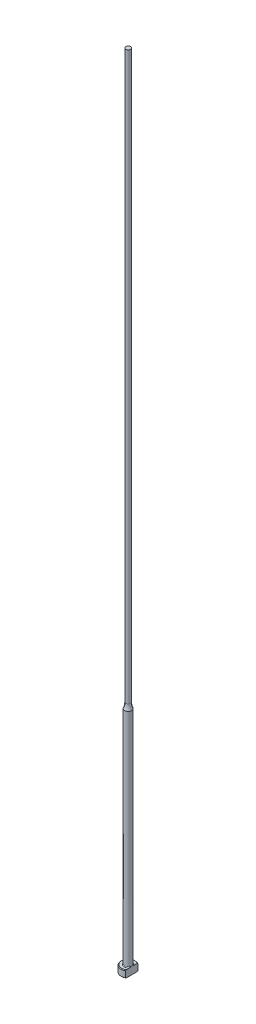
ISO-10303-21;
HEADER;
FILE_DESCRIPTION(('STEP AP214'),'2;1');
FILE_NAME('part.step','',(''),(''),'','','');
FILE_SCHEMA(('AUTOMOTIVE_DESIGN { 1 0 10303 214 1 1 1 1 }'));
ENDSEC;
DATA;
#1=APPLICATION_CONTEXT('core data for automotive mechanical design processes');
#2=APPLICATION_PROTOCOL_DEFINITION('international standard','automotive_design',2000,#1);
#3=PRODUCT_CONTEXT('',#1,'mechanical');
#4=PRODUCT('Part','Part','',(#3));
#5=PRODUCT_RELATED_PRODUCT_CATEGORY('part','',(#4));
#6=PRODUCT_DEFINITION_FORMATION('','',#4);
#7=PRODUCT_DEFINITION_CONTEXT('part definition',#1,'design');
#8=PRODUCT_DEFINITION('design','',#6,#7);
#9=PRODUCT_DEFINITION_SHAPE('','',#8);
#10=(LENGTH_UNIT() NAMED_UNIT(*) SI_UNIT(.MILLI.,.METRE.));
#11=(NAMED_UNIT(*) PLANE_ANGLE_UNIT() SI_UNIT($,.RADIAN.));
#12=(NAMED_UNIT(*) SI_UNIT($,.STERADIAN.) SOLID_ANGLE_UNIT());
#13=UNCERTAINTY_MEASURE_WITH_UNIT(LENGTH_MEASURE(1.E-05),#10,'distance_accuracy_value','');
#14=(GEOMETRIC_REPRESENTATION_CONTEXT(3) GLOBAL_UNCERTAINTY_ASSIGNED_CONTEXT((#13)) GLOBAL_UNIT_ASSIGNED_CONTEXT((#10,
#11,#12)) REPRESENTATION_CONTEXT('',''));
#15=CARTESIAN_POINT('',(0.,0.,0.));
#16=DIRECTION('',(0.,0.,1.));
#17=DIRECTION('',(1.,0.,0.));
#18=AXIS2_PLACEMENT_3D('',#15,#16,#17);
#19=CARTESIAN_POINT('',(-3.17499999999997,3.175,0.));
#20=DIRECTION('',(0.,1.,0.));
#21=DIRECTION('',(0.,0.,1.));
#22=AXIS2_PLACEMENT_3D('',#19,#20,#21);
#23=PLANE('',#22);
#24=CARTESIAN_POINT('',(0.,3.175,0.));
#25=DIRECTION('',(0.,1.,0.));
#26=DIRECTION('',(0.,0.,1.));
#27=AXIS2_PLACEMENT_3D('',#24,#25,#26);
#28=CIRCLE('',#27,2.92099999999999);
#29=CARTESIAN_POINT('',(1.58749999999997,3.175,-2.4519552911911));
#30=VERTEX_POINT('',#29);
#31=CARTESIAN_POINT('',(1.58749999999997,3.175,2.4519552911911));
#32=VERTEX_POINT('',#31);
#33=EDGE_CURVE('E105',#30,#32,#28,.T.);
#34=ORIENTED_EDGE('',*,*,#33,.T.);
#35=DIRECTION('',(0.,0.,1.));
#36=VECTOR('',#35,1.);
#37=CARTESIAN_POINT('',(1.58749999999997,3.17499999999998,2.74963065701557));
#38=LINE('',#37,#36);
#39=CARTESIAN_POINT('',(1.58749999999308,3.175,0.933255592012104));
#40=VERTEX_POINT('',#39);
#41=EDGE_CURVE('E126',#40,#32,#38,.T.);
#42=ORIENTED_EDGE('',*,*,#41,.F.);
#43=CARTESIAN_POINT('',(0.,3.175,0.));
#44=DIRECTION('',(0.,1.,0.));
#45=DIRECTION('',(0.,0.,1.));
#46=AXIS2_PLACEMENT_3D('',#43,#44,#45);
#47=CIRCLE('',#46,1.84149999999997);
#48=CARTESIAN_POINT('',(1.58749999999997,3.17500000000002,-0.933255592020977));
#49=VERTEX_POINT('',#48);
#50=EDGE_CURVE('E11',#40,#49,#47,.F.);
#51=ORIENTED_EDGE('',*,*,#50,.T.);
#52=EDGE_CURVE('E52',#30,#49,#38,.T.);
#53=ORIENTED_EDGE('',*,*,#52,.F.);
#54=EDGE_LOOP('',(#34,#42,#51,#53));
#55=FACE_BOUND('',#54,.T.);
#56=ADVANCED_FACE('F32',(#55),#23,.T.);
#57=CARTESIAN_POINT('',(0.,259.958771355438,0.));
#58=DIRECTION('',(0.,1.,0.));
#59=DIRECTION('',(0.,0.,1.));
#60=AXIS2_PLACEMENT_3D('',#57,#58,#59);
#61=CYLINDRICAL_SURFACE('',#60,3.17499999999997);
#62=CARTESIAN_POINT('',(0.,2.92100000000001,0.));
#63=DIRECTION('',(0.,1.,0.));
#64=DIRECTION('',(0.,0.,1.));
#65=AXIS2_PLACEMENT_3D('',#62,#63,#64);
#66=CIRCLE('',#65,3.17499999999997);
#67=CARTESIAN_POINT('',(1.58749999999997,2.92100000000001,2.74963065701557));
#68=VERTEX_POINT('',#67);
#69=CARTESIAN_POINT('',(1.58749999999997,2.92100000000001,-2.74963065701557));
#70=VERTEX_POINT('',#69);
#71=EDGE_CURVE('E98',#68,#70,#66,.F.);
#72=ORIENTED_EDGE('',*,*,#71,.T.);
#73=DIRECTION('',(0.,-1.,0.));
#74=VECTOR('',#73,1.);
#75=CARTESIAN_POINT('',(1.58749999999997,355.601,-2.74963065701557));
#76=LINE('',#75,#74);
#77=CARTESIAN_POINT('',(1.58749999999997,0.253999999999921,-2.74963065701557));
#78=VERTEX_POINT('',#77);
#79=EDGE_CURVE('E141',#70,#78,#76,.T.);
#80=ORIENTED_EDGE('',*,*,#79,.T.);
#81=CARTESIAN_POINT('',(0.,0.253999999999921,0.));
#82=DIRECTION('',(0.,-1.,0.));
#83=DIRECTION('',(0.,0.,-1.));
#84=AXIS2_PLACEMENT_3D('',#81,#82,#83);
#85=CIRCLE('',#84,3.17499999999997);
#86=CARTESIAN_POINT('',(1.58749999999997,0.253999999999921,2.74963065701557));
#87=VERTEX_POINT('',#86);
#88=EDGE_CURVE('E95',#78,#87,#85,.F.);
#89=ORIENTED_EDGE('',*,*,#88,.T.);
#90=DIRECTION('',(0.,-1.,0.));
#91=VECTOR('',#90,1.);
#92=CARTESIAN_POINT('',(1.58749999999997,355.601,2.74963065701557));
#93=LINE('',#92,#91);
#94=EDGE_CURVE('E88',#68,#87,#93,.T.);
#95=ORIENTED_EDGE('',*,*,#94,.F.);
#96=EDGE_LOOP('',(#72,#80,#89,#95));
#97=FACE_BOUND('',#96,.T.);
#98=ADVANCED_FACE('F191',(#97),#61,.T.);
#99=CARTESIAN_POINT('',(0.,0.,0.));
#100=DIRECTION('',(0.,-1.,0.));
#101=DIRECTION('',(0.,0.,-1.));
#102=AXIS2_PLACEMENT_3D('',#99,#100,#101);
#103=PLANE('',#102);
#104=CARTESIAN_POINT('',(0.,0.,0.));
#105=DIRECTION('',(0.,-1.,0.));
#106=DIRECTION('',(0.,0.,-1.));
#107=AXIS2_PLACEMENT_3D('',#104,#105,#106);
#108=CIRCLE('',#107,2.92100000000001);
#109=CARTESIAN_POINT('',(1.58749999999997,0.,2.45195529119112));
#110=VERTEX_POINT('',#109);
#111=CARTESIAN_POINT('',(1.58749999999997,0.,-2.45195529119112));
#112=VERTEX_POINT('',#111);
#113=EDGE_CURVE('E93',#110,#112,#108,.T.);
#114=ORIENTED_EDGE('',*,*,#113,.T.);
#115=DIRECTION('',(0.,0.,1.));
#116=VECTOR('',#115,1.);
#117=CARTESIAN_POINT('',(1.58749999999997,0.,2.74963065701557));
#118=LINE('',#117,#116);
#119=EDGE_CURVE('E78',#112,#110,#118,.T.);
#120=ORIENTED_EDGE('',*,*,#119,.T.);
#121=EDGE_LOOP('',(#114,#120));
#122=FACE_BOUND('',#121,.T.);
#123=ADVANCED_FACE('F97',(#122),#103,.T.);
#124=CARTESIAN_POINT('',(0.,3.17499999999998,0.));
#125=DIRECTION('',(0.,-1.,0.));
#126=DIRECTION('',(0.,0.,-1.));
#127=AXIS2_PLACEMENT_3D('',#124,#125,#126);
#128=CONICAL_SURFACE('',#127,2.92100000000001,0.785398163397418);
#129=ORIENTED_EDGE('',*,*,#71,.F.);
#130=CARTESIAN_POINT('',(1.58749999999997,-0.161620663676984,-6.0529050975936));
#131=CARTESIAN_POINT('',(1.58749999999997,-0.0288893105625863,-5.91567682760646));
#132=CARTESIAN_POINT('',(1.58749999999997,0.103699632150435,-5.77831035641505));
#133=CARTESIAN_POINT('',(1.58749999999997,0.368508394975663,-5.50321874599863));
#134=CARTESIAN_POINT('',(1.58749999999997,0.5007282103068,-5.3654936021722));
#135=CARTESIAN_POINT('',(1.58749999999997,0.764778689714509,-5.08953516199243));
#136=CARTESIAN_POINT('',(1.58749999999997,0.896609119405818,-4.95130164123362));
#137=CARTESIAN_POINT('',(1.58749999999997,1.15968706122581,-4.67428233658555));
#138=CARTESIAN_POINT('',(1.58749999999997,1.29093457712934,-4.5354965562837));
#139=CARTESIAN_POINT('',(1.58749999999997,1.55007705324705,-4.25997724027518));
#140=CARTESIAN_POINT('',(1.58749999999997,1.67798684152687,-4.12325766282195));
#141=CARTESIAN_POINT('',(1.58749999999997,1.9328486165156,-3.84892898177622));
#142=CARTESIAN_POINT('',(1.58749999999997,2.05980060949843,-3.71131988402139));
#143=CARTESIAN_POINT('',(1.58749999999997,2.31237508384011,-3.43493978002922));
#144=CARTESIAN_POINT('',(1.58749999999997,2.43799784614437,-3.29616903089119));
#145=CARTESIAN_POINT('',(1.58749999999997,2.68741369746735,-3.01699558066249));
#146=CARTESIAN_POINT('',(1.58749999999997,2.81120686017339,-2.8765929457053));
#147=CARTESIAN_POINT('',(1.58749999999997,3.00875865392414,-2.64816703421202));
#148=CARTESIAN_POINT('',(1.58749999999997,3.08336151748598,-2.56087478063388));
#149=CARTESIAN_POINT('',(1.58749999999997,3.23123871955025,-2.385154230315));
#150=CARTESIAN_POINT('',(1.58749999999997,3.30451292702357,-2.29672582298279));
#151=CARTESIAN_POINT('',(1.58749999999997,3.45004422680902,-2.11747400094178));
#152=CARTESIAN_POINT('',(1.58749999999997,3.52228237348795,-2.02663514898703));
#153=CARTESIAN_POINT('',(1.58749999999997,3.66423097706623,-1.84302524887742));
#154=CARTESIAN_POINT('',(1.58749999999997,3.73394203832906,-1.75025467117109));
#155=CARTESIAN_POINT('',(1.58749999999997,3.87080633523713,-1.56067475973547));
#156=CARTESIAN_POINT('',(1.58749999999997,3.93790459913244,-1.46382547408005));
#157=CARTESIAN_POINT('',(1.58749999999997,4.06669147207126,-1.26632594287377));
#158=CARTESIAN_POINT('',(1.58749999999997,4.12837264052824,-1.16567073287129));
#159=CARTESIAN_POINT('',(1.58749999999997,4.21402252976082,-1.01165766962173));
#160=CARTESIAN_POINT('',(1.58749999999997,4.2412792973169,-0.960142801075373));
#161=CARTESIAN_POINT('',(1.58749999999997,4.29309798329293,-0.85578092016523));
#162=CARTESIAN_POINT('',(1.58749999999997,4.3176594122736,-0.802933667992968));
#163=CARTESIAN_POINT('',(1.58749999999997,4.38614656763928,-0.642461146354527));
#164=CARTESIAN_POINT('',(1.58749999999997,4.42510149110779,-0.532518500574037));
#165=CARTESIAN_POINT('',(1.58749999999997,4.46726244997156,-0.367680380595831));
#166=CARTESIAN_POINT('',(1.58749999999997,4.47844427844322,-0.314802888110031));
#167=CARTESIAN_POINT('',(1.58749999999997,4.49576654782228,-0.208209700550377));
#168=CARTESIAN_POINT('',(1.58749999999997,4.50190743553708,-0.154494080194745));
#169=CARTESIAN_POINT('',(1.58749999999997,4.50871296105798,-0.0468792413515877));
#170=CARTESIAN_POINT('',(1.58749999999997,4.50939451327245,0.00701889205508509));
#171=CARTESIAN_POINT('',(1.58749999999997,4.5052767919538,0.114606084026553));
#172=CARTESIAN_POINT('',(1.58749999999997,4.5004770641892,0.16829512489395));
#173=CARTESIAN_POINT('',(1.58749999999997,4.48579689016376,0.274485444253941));
#174=CARTESIAN_POINT('',(1.58749999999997,4.47596081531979,0.326992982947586));
#175=CARTESIAN_POINT('',(1.58749999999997,4.4518180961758,0.430974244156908));
#176=CARTESIAN_POINT('',(1.58749999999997,4.43750969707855,0.482447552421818));
#177=CARTESIAN_POINT('',(1.58749999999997,4.40502489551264,0.58446088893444));
#178=CARTESIAN_POINT('',(1.58749999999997,4.38682724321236,0.634994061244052));
#179=CARTESIAN_POINT('',(1.58749999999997,4.34729308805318,0.734789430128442));
#180=CARTESIAN_POINT('',(1.58749999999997,4.32595722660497,0.784051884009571));
#181=CARTESIAN_POINT('',(1.58749999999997,4.25791922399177,0.93054934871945));
#182=CARTESIAN_POINT('',(1.58749999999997,4.20736047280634,1.02598802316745));
#183=CARTESIAN_POINT('',(1.58749999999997,4.09955451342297,1.21304313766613));
#184=CARTESIAN_POINT('',(1.58749999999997,4.04229912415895,1.30465471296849));
#185=CARTESIAN_POINT('',(1.58749999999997,3.92308746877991,1.48526211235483));
#186=CARTESIAN_POINT('',(1.58749999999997,3.86111349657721,1.57424615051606));
#187=CARTESIAN_POINT('',(1.58749999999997,3.73408621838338,1.74990003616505));
#188=CARTESIAN_POINT('',(1.58749999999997,3.66903444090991,1.83657099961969));
#189=CARTESIAN_POINT('',(1.58749999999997,3.53583371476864,2.009317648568));
#190=CARTESIAN_POINT('',(1.58749999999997,3.46765527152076,2.09537048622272));
#191=CARTESIAN_POINT('',(1.58749999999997,3.32960643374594,2.26611736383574));
#192=CARTESIAN_POINT('',(1.58749999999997,3.25973586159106,2.35081125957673));
#193=CARTESIAN_POINT('',(1.58749999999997,3.04858139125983,2.60290121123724));
#194=CARTESIAN_POINT('',(1.58749999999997,2.90542388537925,2.7687253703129));
#195=CARTESIAN_POINT('',(1.58749999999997,2.64069522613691,3.06970913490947));
#196=CARTESIAN_POINT('',(1.58749999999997,2.5195945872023,3.20528660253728));
#197=CARTESIAN_POINT('',(1.58749999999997,2.27590400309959,3.47510321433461));
#198=CARTESIAN_POINT('',(1.58749999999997,2.1533140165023,3.60934232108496));
#199=CARTESIAN_POINT('',(1.58749999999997,1.9069423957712,3.87695374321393));
#200=CARTESIAN_POINT('',(1.58749999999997,1.78315974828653,4.01032512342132));
#201=CARTESIAN_POINT('',(1.58749999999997,1.53478104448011,4.2763088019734));
#202=CARTESIAN_POINT('',(1.58749999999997,1.41018498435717,4.40892109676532));
#203=CARTESIAN_POINT('',(1.58749999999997,1.04574684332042,4.79499418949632));
#204=CARTESIAN_POINT('',(1.58749999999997,0.805076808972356,5.04767313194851));
#205=CARTESIAN_POINT('',(1.58749999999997,0.44312150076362,5.42550911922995));
#206=CARTESIAN_POINT('',(1.58749999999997,0.322378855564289,5.55118772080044));
#207=CARTESIAN_POINT('',(1.58749999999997,0.0805914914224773,5.8022520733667));
#208=CARTESIAN_POINT('',(1.58749999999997,-0.0404532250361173,5.92763782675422));
#209=CARTESIAN_POINT('',(1.58749999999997,-0.161620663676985,6.0529050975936));
#210=B_SPLINE_CURVE_WITH_KNOTS('',3,(#130,#131,#132,#133,#134,#135,#136,#137,#138,#139,#140,
#141,#142,#143,#144,#145,#146,#147,#148,#149,#150,#151,#152,#153,#154,#155,#156,#157,#158,#159,
#160,#161,#162,#163,#164,#165,#166,#167,#168,#169,#170,#171,#172,#173,#174,#175,#176,#177,#178,
#179,#180,#181,#182,#183,#184,#185,#186,#187,#188,#189,#190,#191,#192,#193,#194,#195,#196,#197,
#198,#199,#200,#201,#202,#203,#204,#205,#206,#207,#208,#209),.UNSPECIFIED.,.F.,.F.,(4,2,2,2,2,2,
2,2,2,2,2,2,2,2,2,2,2,2,2,2,2,2,2,2,2,2,2,2,2,2,2,2,2,2,2,2,2,2,2,4),(0.,0.572750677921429,
1.14550874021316,1.71856057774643,2.29160869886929,2.85328006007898,3.41494773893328,
3.97649423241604,4.53801804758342,4.88249307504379,5.2270018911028,5.57515326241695,
5.92322081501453,6.27657800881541,6.63041319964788,6.80518126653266,6.97998101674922,
7.32824262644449,7.49018491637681,7.65211285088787,7.81353889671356,7.97497832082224,
8.13501929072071,8.29512313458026,8.45612518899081,8.61709438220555,8.94062993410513,
9.26456495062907,9.58978187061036,9.91483894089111,10.2441741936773,10.5735441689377,
11.2306812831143,11.7760337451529,12.3214014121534,12.8672825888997,13.4131663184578,
14.4600164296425,14.9828595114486,15.505698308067),.UNSPECIFIED.);
#211=EDGE_CURVE('E118',#32,#68,#210,.T.);
#212=ORIENTED_EDGE('',*,*,#211,.F.);
#213=ORIENTED_EDGE('',*,*,#33,.F.);
#214=EDGE_CURVE('E117',#70,#30,#210,.T.);
#215=ORIENTED_EDGE('',*,*,#214,.F.);
#216=EDGE_LOOP('',(#129,#212,#213,#215));
#217=FACE_BOUND('',#216,.T.);
#218=ADVANCED_FACE('F162',(#217),#128,.T.);
#219=CARTESIAN_POINT('',(0.,0.253999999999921,0.));
#220=DIRECTION('',(0.,1.,0.));
#221=DIRECTION('',(0.,0.,1.));
#222=AXIS2_PLACEMENT_3D('',#219,#220,#221);
#223=CONICAL_SURFACE('',#222,3.17499999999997,0.785398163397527);
#224=ORIENTED_EDGE('',*,*,#88,.F.);
#225=CARTESIAN_POINT('',(1.58749999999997,3.33662066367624,6.0529050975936));
#226=CARTESIAN_POINT('',(1.58749999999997,3.20388931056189,5.91567682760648));
#227=CARTESIAN_POINT('',(1.58749999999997,3.07130036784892,5.7783103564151));
#228=CARTESIAN_POINT('',(1.58749999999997,2.80649160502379,5.50321874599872));
#229=CARTESIAN_POINT('',(1.58749999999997,2.6742717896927,5.36549360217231));
#230=CARTESIAN_POINT('',(1.58749999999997,2.41022131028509,5.08953516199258));
#231=CARTESIAN_POINT('',(1.58749999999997,2.27839088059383,4.95130164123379));
#232=CARTESIAN_POINT('',(1.58749999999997,2.01531293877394,4.67428233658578));
#233=CARTESIAN_POINT('',(1.58749999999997,1.88406542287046,4.53549655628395));
#234=CARTESIAN_POINT('',(1.58749999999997,1.62492294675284,4.25997724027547));
#235=CARTESIAN_POINT('',(1.58749999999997,1.49701315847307,4.12325766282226));
#236=CARTESIAN_POINT('',(1.58749999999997,1.24215138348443,3.84892898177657));
#237=CARTESIAN_POINT('',(1.58749999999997,1.11519939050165,3.71131988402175));
#238=CARTESIAN_POINT('',(1.58749999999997,0.862624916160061,3.43493978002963));
#239=CARTESIAN_POINT('',(1.58749999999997,0.737002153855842,3.29616903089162));
#240=CARTESIAN_POINT('',(1.58749999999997,0.487586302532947,3.01699558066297));
#241=CARTESIAN_POINT('',(1.58749999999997,0.363793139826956,2.8765929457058));
#242=CARTESIAN_POINT('',(1.58749999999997,0.166241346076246,2.64816703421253));
#243=CARTESIAN_POINT('',(1.58749999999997,0.0916384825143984,2.56087478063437));
#244=CARTESIAN_POINT('',(1.58749999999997,-0.0562387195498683,2.38515423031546));
#245=CARTESIAN_POINT('',(1.58749999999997,-0.129512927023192,2.29672582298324));
#246=CARTESIAN_POINT('',(1.58749999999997,-0.275044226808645,2.1174740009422));
#247=CARTESIAN_POINT('',(1.58749999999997,-0.347282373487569,2.02663514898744));
#248=CARTESIAN_POINT('',(1.58749999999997,-0.489230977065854,1.8430252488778));
#249=CARTESIAN_POINT('',(1.58749999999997,-0.558942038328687,1.75025467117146));
#250=CARTESIAN_POINT('',(1.58749999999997,-0.695806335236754,1.5606747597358));
#251=CARTESIAN_POINT('',(1.58749999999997,-0.762904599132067,1.46382547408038));
#252=CARTESIAN_POINT('',(1.58749999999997,-0.89169147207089,1.26632594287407));
#253=CARTESIAN_POINT('',(1.58749999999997,-0.953372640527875,1.16567073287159));
#254=CARTESIAN_POINT('',(1.58749999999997,-1.03902252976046,1.01165766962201));
#255=CARTESIAN_POINT('',(1.58749999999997,-1.06627929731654,0.960142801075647));
#256=CARTESIAN_POINT('',(1.58749999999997,-1.11809798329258,0.855780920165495));
#257=CARTESIAN_POINT('',(1.58749999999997,-1.14265941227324,0.802933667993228));
#258=CARTESIAN_POINT('',(1.58749999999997,-1.21114656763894,0.642461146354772));
#259=CARTESIAN_POINT('',(1.58749999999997,-1.25010149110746,0.532518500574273));
#260=CARTESIAN_POINT('',(1.58749999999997,-1.29226244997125,0.367680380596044));
#261=CARTESIAN_POINT('',(1.58749999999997,-1.30344427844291,0.314802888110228));
#262=CARTESIAN_POINT('',(1.58749999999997,-1.32076654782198,0.208209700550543));
#263=CARTESIAN_POINT('',(1.58749999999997,-1.32690743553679,0.154494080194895));
#264=CARTESIAN_POINT('',(1.58749999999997,-1.3337129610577,0.0468792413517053));
#265=CARTESIAN_POINT('',(1.58749999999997,-1.33439451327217,-0.00701889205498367));
#266=CARTESIAN_POINT('',(1.58749999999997,-1.33027679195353,-0.114606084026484));
#267=CARTESIAN_POINT('',(1.58749999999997,-1.32547706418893,-0.168295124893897));
#268=CARTESIAN_POINT('',(1.58749999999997,-1.31079689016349,-0.274485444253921));
#269=CARTESIAN_POINT('',(1.58749999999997,-1.30096081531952,-0.326992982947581));
#270=CARTESIAN_POINT('',(1.58749999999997,-1.27681809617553,-0.430974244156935));
#271=CARTESIAN_POINT('',(1.58749999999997,-1.26250969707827,-0.48244755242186));
#272=CARTESIAN_POINT('',(1.58749999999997,-1.23002489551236,-0.584460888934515));
#273=CARTESIAN_POINT('',(1.58749999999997,-1.21182724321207,-0.634994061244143));
#274=CARTESIAN_POINT('',(1.58749999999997,-1.17229308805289,-0.734789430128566));
#275=CARTESIAN_POINT('',(1.58749999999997,-1.15095722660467,-0.784051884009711));
#276=CARTESIAN_POINT('',(1.58749999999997,-1.08291922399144,-0.930549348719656));
#277=CARTESIAN_POINT('',(1.58749999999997,-1.03236047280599,-1.0259880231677));
#278=CARTESIAN_POINT('',(1.58749999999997,-0.924554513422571,-1.21304313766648));
#279=CARTESIAN_POINT('',(1.58749999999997,-0.867299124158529,-1.30465471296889));
#280=CARTESIAN_POINT('',(1.58749999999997,-0.748087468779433,-1.48526211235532));
#281=CARTESIAN_POINT('',(1.58749999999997,-0.686113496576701,-1.5742461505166));
#282=CARTESIAN_POINT('',(1.58749999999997,-0.559086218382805,-1.74990003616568));
#283=CARTESIAN_POINT('',(1.58749999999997,-0.494034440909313,-1.83657099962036));
#284=CARTESIAN_POINT('',(1.58749999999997,-0.360833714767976,-2.00931764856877));
#285=CARTESIAN_POINT('',(1.58749999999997,-0.292655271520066,-2.09537048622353));
#286=CARTESIAN_POINT('',(1.58749999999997,-0.154606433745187,-2.26611736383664));
#287=CARTESIAN_POINT('',(1.58749999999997,-0.0847358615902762,-2.35081125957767));
#288=CARTESIAN_POINT('',(1.58749999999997,0.126418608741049,-2.60290121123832));
#289=CARTESIAN_POINT('',(1.58749999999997,0.269576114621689,-2.76872537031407));
#290=CARTESIAN_POINT('',(1.58749999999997,0.534304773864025,-3.06970913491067));
#291=CARTESIAN_POINT('',(1.58749999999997,0.655405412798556,-3.20528660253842));
#292=CARTESIAN_POINT('',(1.58749999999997,0.899095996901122,-3.47510321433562));
#293=CARTESIAN_POINT('',(1.58749999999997,1.02168598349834,-3.60934232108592));
#294=CARTESIAN_POINT('',(1.58749999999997,1.26805760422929,-3.87695374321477));
#295=CARTESIAN_POINT('',(1.58749999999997,1.39184025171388,-4.0103251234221));
#296=CARTESIAN_POINT('',(1.58749999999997,1.64021895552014,-4.27630880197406));
#297=CARTESIAN_POINT('',(1.58749999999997,1.76481501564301,-4.40892109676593));
#298=CARTESIAN_POINT('',(1.58749999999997,2.12925315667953,-4.79499418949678));
#299=CARTESIAN_POINT('',(1.58749999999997,2.36992319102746,-5.04767313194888));
#300=CARTESIAN_POINT('',(1.58749999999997,2.73187849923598,-5.42550911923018));
#301=CARTESIAN_POINT('',(1.58749999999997,2.85262114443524,-5.55118772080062));
#302=CARTESIAN_POINT('',(1.58749999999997,3.09440850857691,-5.80225207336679));
#303=CARTESIAN_POINT('',(1.58749999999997,3.21545322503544,-5.92763782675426));
#304=CARTESIAN_POINT('',(1.58749999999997,3.33662066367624,-6.0529050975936));
#305=B_SPLINE_CURVE_WITH_KNOTS('',3,(#225,#226,#227,#228,#229,#230,#231,#232,#233,#234,#235,
#236,#237,#238,#239,#240,#241,#242,#243,#244,#245,#246,#247,#248,#249,#250,#251,#252,#253,#254,
#255,#256,#257,#258,#259,#260,#261,#262,#263,#264,#265,#266,#267,#268,#269,#270,#271,#272,#273,
#274,#275,#276,#277,#278,#279,#280,#281,#282,#283,#284,#285,#286,#287,#288,#289,#290,#291,#292,
#293,#294,#295,#296,#297,#298,#299,#300,#301,#302,#303,#304),.UNSPECIFIED.,.F.,.F.,(4,2,2,2,2,2,
2,2,2,2,2,2,2,2,2,2,2,2,2,2,2,2,2,2,2,2,2,2,2,2,2,2,2,2,2,2,2,2,2,4),(0.,0.572750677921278,
1.14550874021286,1.71856057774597,2.29160869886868,2.85328006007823,3.4149477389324,
3.97649423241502,4.53801804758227,4.88249307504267,5.22700189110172,5.5751532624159,
5.92322081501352,6.27657800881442,6.63041319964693,6.80518126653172,6.9799810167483,
7.3282426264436,7.49018491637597,7.65211285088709,7.81353889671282,7.97497832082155,
8.13501929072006,8.29512313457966,8.45612518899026,8.61709438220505,8.9406299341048,
9.2645649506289,9.58978187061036,9.91483894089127,10.2441741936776,10.5735441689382,
11.2306812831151,11.7760337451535,12.3214014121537,12.8672825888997,13.4131663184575,
14.4600164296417,14.9828595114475,15.5056983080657),.UNSPECIFIED.);
#306=EDGE_CURVE('E81',#112,#78,#305,.T.);
#307=ORIENTED_EDGE('',*,*,#306,.F.);
#308=ORIENTED_EDGE('',*,*,#113,.F.);
#309=EDGE_CURVE('E84',#87,#110,#305,.T.);
#310=ORIENTED_EDGE('',*,*,#309,.F.);
#311=EDGE_LOOP('',(#224,#307,#308,#310));
#312=FACE_BOUND('',#311,.T.);
#313=ADVANCED_FACE('F92',(#312),#223,.T.);
#314=CARTESIAN_POINT('',(0.,3.42900000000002,0.));
#315=DIRECTION('',(0.,1.,0.));
#316=DIRECTION('',(0.,0.,1.));
#317=AXIS2_PLACEMENT_3D('',#314,#315,#316);
#318=TOROIDAL_SURFACE('',#317,1.84149999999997,0.254);
#319=CARTESIAN_POINT('',(1.58749999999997,3.42900000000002,0.));
#320=CARTESIAN_POINT('',(1.58749999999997,3.42899942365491,-1.9220514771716E-10));
#321=CARTESIAN_POINT('',(1.58749999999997,3.42899884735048,-1.2261161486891E-07));
#322=CARTESIAN_POINT('',(1.58749999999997,3.42899773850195,-5.09676365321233E-07));
#323=CARTESIAN_POINT('',(1.58749999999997,3.42899720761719,-7.78176328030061E-07));
#324=CARTESIAN_POINT('',(1.58749999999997,3.42899614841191,-1.42307272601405E-06));
#325=CARTESIAN_POINT('',(1.58749999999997,3.42899562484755,-1.80713867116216E-06));
#326=CARTESIAN_POINT('',(1.58749999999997,3.42899463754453,-2.63494846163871E-06));
#327=CARTESIAN_POINT('',(1.58749999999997,3.42899417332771,-3.07814756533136E-06));
#328=CARTESIAN_POINT('',(1.58749999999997,3.42899261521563,-4.66897357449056E-06));
#329=CARTESIAN_POINT('',(1.58749999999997,3.42899159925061,-5.89404908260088E-06));
#330=CARTESIAN_POINT('',(1.58749999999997,3.42898979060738,-8.42427511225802E-06));
#331=CARTESIAN_POINT('',(1.58749999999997,3.42898899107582,-9.7248057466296E-06));
#332=CARTESIAN_POINT('',(1.58749999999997,3.42898598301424,-1.48060601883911E-05));
#333=CARTESIAN_POINT('',(1.58749999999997,3.42898393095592,-1.86838281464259E-05));
#334=CARTESIAN_POINT('',(1.58749999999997,3.42898057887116,-2.63261117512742E-05));
#335=CARTESIAN_POINT('',(1.58749999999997,3.42897922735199,-3.00687417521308E-05));
#336=CARTESIAN_POINT('',(1.58749999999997,3.42897347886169,-4.60276298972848E-05));
#337=CARTESIAN_POINT('',(1.58749999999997,3.42896911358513,-5.8247019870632E-05));
#338=CARTESIAN_POINT('',(1.58749999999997,3.42896211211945,-8.11070097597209E-05));
#339=CARTESIAN_POINT('',(1.58749999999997,3.42895931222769,-9.16953114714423E-05));
#340=CARTESIAN_POINT('',(1.58749999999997,3.42893712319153,-0.000168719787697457));
#341=CARTESIAN_POINT('',(1.58749999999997,3.42890881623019,-0.000232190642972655));
#342=CARTESIAN_POINT('',(1.58749999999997,3.42880276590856,-0.000479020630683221));
#343=CARTESIAN_POINT('',(1.58749999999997,3.42873165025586,-0.00066443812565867));
#344=CARTESIAN_POINT('',(1.58749999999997,3.42845137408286,-0.0013844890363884));
#345=CARTESIAN_POINT('',(1.58749999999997,3.42823526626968,-0.00191701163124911));
#346=CARTESIAN_POINT('',(1.58749999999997,3.42735449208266,-0.00409774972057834));
#347=CARTESIAN_POINT('',(1.58749999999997,3.42669768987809,-0.00574830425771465));
#348=CARTESIAN_POINT('',(1.58749999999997,3.4174405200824,-0.0289985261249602));
#349=CARTESIAN_POINT('',(1.58749999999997,3.40878325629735,-0.0505816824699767));
#350=CARTESIAN_POINT('',(1.58749999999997,3.39189297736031,-0.0929947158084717));
#351=CARTESIAN_POINT('',(1.58749999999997,3.38365605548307,-0.11382315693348));
#352=CARTESIAN_POINT('',(1.58749999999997,3.36635393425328,-0.157956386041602));
#353=CARTESIAN_POINT('',(1.58749999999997,3.35730391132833,-0.181267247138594));
#354=CARTESIAN_POINT('',(1.58749999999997,3.33936775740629,-0.228222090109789));
#355=CARTESIAN_POINT('',(1.58749999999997,3.33048420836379,-0.25186705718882));
#356=CARTESIAN_POINT('',(1.58749999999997,3.30894496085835,-0.310512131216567));
#357=CARTESIAN_POINT('',(1.58749999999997,3.29649449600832,-0.345588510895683));
#358=CARTESIAN_POINT('',(1.58749999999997,3.27296975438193,-0.415278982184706));
#359=CARTESIAN_POINT('',(1.58749999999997,3.26186987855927,-0.449884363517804));
#360=CARTESIAN_POINT('',(1.58749999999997,3.2395832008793,-0.524471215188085));
#361=CARTESIAN_POINT('',(1.58749999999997,3.22860862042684,-0.564517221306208));
#362=CARTESIAN_POINT('',(1.58749999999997,3.20902534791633,-0.645529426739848));
#363=CARTESIAN_POINT('',(1.58749999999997,3.20043582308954,-0.686500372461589));
#364=CARTESIAN_POINT('',(1.58749999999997,3.18611712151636,-0.771546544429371));
#365=CARTESIAN_POINT('',(1.58749999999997,3.18059550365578,-0.815658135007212));
#366=CARTESIAN_POINT('',(1.58749999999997,3.17455396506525,-0.904117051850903));
#367=CARTESIAN_POINT('',(1.58749999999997,3.17401361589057,-0.948462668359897));
#368=CARTESIAN_POINT('',(1.58749999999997,3.17898948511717,-1.02531896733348));
#369=CARTESIAN_POINT('',(1.58749999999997,3.1829739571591,-1.05792141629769));
#370=CARTESIAN_POINT('',(1.58749999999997,3.19569167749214,-1.12184393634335));
#371=CARTESIAN_POINT('',(1.58749999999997,3.20436049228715,-1.1531753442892));
#372=CARTESIAN_POINT('',(1.58749999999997,3.22236152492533,-1.19946468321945));
#373=CARTESIAN_POINT('',(1.58749999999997,3.2295150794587,-1.21526783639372));
#374=CARTESIAN_POINT('',(1.58749999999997,3.24587062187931,-1.24583726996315));
#375=CARTESIAN_POINT('',(1.58749999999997,3.25507530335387,-1.26060215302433));
#376=CARTESIAN_POINT('',(1.58749999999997,3.27378481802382,-1.28575815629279));
#377=CARTESIAN_POINT('',(1.58749999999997,3.28289001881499,-1.29644383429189));
#378=CARTESIAN_POINT('',(1.58749999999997,3.30268460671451,-1.31623154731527));
#379=CARTESIAN_POINT('',(1.58749999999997,3.31337067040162,-1.32533681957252));
#380=CARTESIAN_POINT('',(1.58749999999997,3.33349977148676,-1.33941140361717));
#381=CARTESIAN_POINT('',(1.58749999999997,3.34261446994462,-1.34484814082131));
#382=CARTESIAN_POINT('',(1.58749999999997,3.36161455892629,-1.35416329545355));
#383=CARTESIAN_POINT('',(1.58749999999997,3.37149946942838,-1.35804267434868));
#384=CARTESIAN_POINT('',(1.58749999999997,3.39188678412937,-1.36398436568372));
#385=CARTESIAN_POINT('',(1.58749999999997,3.40239309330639,-1.36603350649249));
#386=CARTESIAN_POINT('',(1.58749999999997,3.42360372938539,-1.3680840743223));
#387=CARTESIAN_POINT('',(1.58749999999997,3.43430795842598,-1.36808648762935));
#388=CARTESIAN_POINT('',(1.58749999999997,3.45433283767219,-1.36616208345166));
#389=CARTESIAN_POINT('',(1.58749999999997,3.46367506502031,-1.36444960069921));
#390=CARTESIAN_POINT('',(1.58749999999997,3.48195519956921,-1.35953338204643));
#391=CARTESIAN_POINT('',(1.58749999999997,3.49089304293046,-1.3563294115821));
#392=CARTESIAN_POINT('',(1.58749999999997,3.50850302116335,-1.34848006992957));
#393=CARTESIAN_POINT('',(1.58749999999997,3.5171531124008,-1.34378578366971));
#394=CARTESIAN_POINT('',(1.58749999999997,3.53371257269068,-1.33324445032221));
#395=CARTESIAN_POINT('',(1.58749999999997,3.54162163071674,-1.32739692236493));
#396=CARTESIAN_POINT('',(1.58749999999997,3.56107121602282,-1.31107304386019));
#397=CARTESIAN_POINT('',(1.58749999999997,3.57202221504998,-1.29989286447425));
#398=CARTESIAN_POINT('',(1.58749999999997,3.59202509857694,-1.27593566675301));
#399=CARTESIAN_POINT('',(1.58749999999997,3.60107086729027,-1.26315370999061));
#400=CARTESIAN_POINT('',(1.58749999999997,3.62186023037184,-1.22930733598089));
#401=CARTESIAN_POINT('',(1.58749999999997,3.63240584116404,-1.20751096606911));
#402=CARTESIAN_POINT('',(1.58749999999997,3.65004643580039,-1.16266144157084));
#403=CARTESIAN_POINT('',(1.58749999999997,3.65714435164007,-1.13960937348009));
#404=CARTESIAN_POINT('',(1.58749999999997,3.67265428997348,-1.07603916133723));
#405=CARTESIAN_POINT('',(1.58749999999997,3.67834921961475,-1.03486686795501));
#406=CARTESIAN_POINT('',(1.58749999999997,3.68382880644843,-0.951558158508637));
#407=CARTESIAN_POINT('',(1.58749999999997,3.68350976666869,-0.909417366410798));
#408=CARTESIAN_POINT('',(1.58749999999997,3.67745397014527,-0.811383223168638));
#409=CARTESIAN_POINT('',(1.58749999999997,3.66993873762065,-0.755610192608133));
#410=CARTESIAN_POINT('',(1.58749999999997,3.64933373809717,-0.644937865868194));
#411=CARTESIAN_POINT('',(1.58749999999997,3.63621897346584,-0.59004364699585));
#412=CARTESIAN_POINT('',(1.58749999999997,3.60740922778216,-0.485757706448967));
#413=CARTESIAN_POINT('',(1.58749999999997,3.59201096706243,-0.436281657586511));
#414=CARTESIAN_POINT('',(1.58749999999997,3.55922497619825,-0.338551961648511));
#415=CARTESIAN_POINT('',(1.58749999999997,3.5418584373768,-0.290291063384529));
#416=CARTESIAN_POINT('',(1.58749999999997,3.51760237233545,-0.225557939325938));
#417=CARTESIAN_POINT('',(1.58749999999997,3.51126413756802,-0.208874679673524));
#418=CARTESIAN_POINT('',(1.58749999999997,3.49830042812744,-0.17512392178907));
#419=CARTESIAN_POINT('',(1.58749999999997,3.49167176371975,-0.158057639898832));
#420=CARTESIAN_POINT('',(1.58749999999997,3.47585523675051,-0.117638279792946));
#421=CARTESIAN_POINT('',(1.58749999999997,3.46662970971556,-0.0943002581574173));
#422=CARTESIAN_POINT('',(1.58749999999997,3.44889695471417,-0.0497824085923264));
#423=CARTESIAN_POINT('',(1.58749999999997,3.44040039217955,-0.028598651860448));
#424=CARTESIAN_POINT('',(1.58749999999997,3.43130364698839,-0.00575168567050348));
#425=CARTESIAN_POINT('',(1.58749999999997,3.43064818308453,-0.00410451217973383));
#426=CARTESIAN_POINT('',(1.58749999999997,3.42976776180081,-0.00192459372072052));
#427=CARTESIAN_POINT('',(1.58749999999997,3.42955062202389,-0.00138952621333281));
#428=CARTESIAN_POINT('',(1.58749999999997,3.42926908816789,-0.000666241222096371));
#429=CARTESIAN_POINT('',(1.58749999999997,3.42919771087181,-0.000480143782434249));
#430=CARTESIAN_POINT('',(1.58749999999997,3.42909131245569,-0.000232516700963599));
#431=CARTESIAN_POINT('',(1.58749999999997,3.42906294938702,-0.000168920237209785));
#432=CARTESIAN_POINT('',(1.58749999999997,3.42904072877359,-9.17527162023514E-05));
#433=CARTESIAN_POINT('',(1.58749999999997,3.42903792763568,-8.11550293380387E-05));
#434=CARTESIAN_POINT('',(1.58749999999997,3.42903091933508,-5.82743948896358E-05));
#435=CARTESIAN_POINT('',(1.58749999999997,3.42902654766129,-4.60440001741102E-05));
#436=CARTESIAN_POINT('',(1.58749999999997,3.42902079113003,-3.00727682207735E-05));
#437=CARTESIAN_POINT('',(1.58749999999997,3.42901943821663,-2.63286807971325E-05));
#438=CARTESIAN_POINT('',(1.58749999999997,3.42901608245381,-1.86836529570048E-05));
#439=CARTESIAN_POINT('',(1.58749999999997,3.4290140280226,-1.48046517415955E-05));
#440=CARTESIAN_POINT('',(1.58749999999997,3.42901101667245,-9.72223943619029E-06));
#441=CARTESIAN_POINT('',(1.58749999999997,3.42901021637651,-8.42159649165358E-06));
#442=CARTESIAN_POINT('',(1.58749999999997,3.42900840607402,-5.89129729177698E-06));
#443=CARTESIAN_POINT('',(1.58749999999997,3.42900738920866,-4.66626867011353E-06));
#444=CARTESIAN_POINT('',(1.58749999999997,3.42900582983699,-3.07568803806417E-06));
#445=CARTESIAN_POINT('',(1.58749999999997,3.42900536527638,-2.63259565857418E-06));
#446=CARTESIAN_POINT('',(1.58749999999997,3.4290043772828,-1.80506085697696E-06));
#447=CARTESIAN_POINT('',(1.58749999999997,3.42900385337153,-1.42116387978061E-06));
#448=CARTESIAN_POINT('',(1.58749999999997,3.42900279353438,-7.76675643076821E-07));
#449=CARTESIAN_POINT('',(1.58749999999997,3.42900226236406,-5.08406487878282E-07));
#450=CARTESIAN_POINT('',(1.58749999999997,3.42900115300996,-1.21901887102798E-07));
#451=CARTESIAN_POINT('',(1.58749999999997,3.42900057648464,1.92251677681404E-10));
#452=CARTESIAN_POINT('',(1.58749999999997,3.42900000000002,0.));
#453=B_SPLINE_CURVE_WITH_KNOTS('',3,(#319,#320,#321,#322,#323,#324,#325,#326,#327,#328,#329,
#330,#331,#332,#333,#334,#335,#336,#337,#338,#339,#340,#341,#342,#343,#344,#345,#346,#347,#348,
#349,#350,#351,#352,#353,#354,#355,#356,#357,#358,#359,#360,#361,#362,#363,#364,#365,#366,#367,
#368,#369,#370,#371,#372,#373,#374,#375,#376,#377,#378,#379,#380,#381,#382,#383,#384,#385,#386,
#387,#388,#389,#390,#391,#392,#393,#394,#395,#396,#397,#398,#399,#400,#401,#402,#403,#404,#405,
#406,#407,#408,#409,#410,#411,#412,#413,#414,#415,#416,#417,#418,#419,#420,#421,#422,#423,#424,
#425,#426,#427,#428,#429,#430,#431,#432,#433,#434,#435,#436,#437,#438,#439,#440,#441,#442,#443,
#444,#445,#446,#447,#448,#449,#450,#451,#452),.UNSPECIFIED.,.T.,.F.,(4,2,2,2,2,2,2,2,2,2,2,2,2,
2,2,2,2,2,2,2,2,2,2,2,2,2,2,2,2,2,2,2,2,2,2,2,2,2,2,2,2,2,2,2,2,2,2,2,2,2,2,2,2,2,2,2,2,2,2,2,2,
2,2,2,2,2,4),(0.,1.72815458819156E-06,3.50429255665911E-06,5.44431004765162E-06,
7.3675525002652E-06,1.2119089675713E-05,1.66953775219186E-05,2.98160400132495E-05,
4.17409564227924E-05,8.0660475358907E-05,0.000113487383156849,0.000321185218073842,
0.000917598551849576,0.00264089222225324,0.00797105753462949,0.0777276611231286,
0.144923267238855,0.219939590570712,0.295714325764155,0.407362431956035,0.516367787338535,
0.640878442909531,0.766362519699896,0.899536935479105,1.03216495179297,1.13045740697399,
1.22743103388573,1.27935899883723,1.33135556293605,1.37333248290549,1.41522237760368,
1.44693946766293,1.47863694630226,1.51056074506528,1.54246916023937,1.57083210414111,
1.59919951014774,1.62861579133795,1.65804436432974,1.70472658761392,1.75155645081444,
1.82378709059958,1.89595619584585,2.01995471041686,2.1460932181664,2.31447224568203,
2.48361094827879,2.6389891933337,2.79283011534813,2.84637031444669,2.9012946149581,
2.97658236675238,3.04504771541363,3.05036697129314,3.05209849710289,3.05269709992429,
3.05290520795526,3.05293806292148,3.05297701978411,3.05298895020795,3.05300207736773,
3.05300665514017,3.0530114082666,3.05301333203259,3.05301527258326,3.05301704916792,
3.05301877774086),.UNSPECIFIED.);
#454=CARTESIAN_POINT('',(1.58749999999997,3.42900000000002,0.));
#455=VERTEX_POINT('',#454);
#456=EDGE_CURVE('E47',#455,#49,#453,.T.);
#457=ORIENTED_EDGE('',*,*,#456,.T.);
#458=ORIENTED_EDGE('',*,*,#50,.F.);
#459=CARTESIAN_POINT('',(1.58749999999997,3.42900000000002,0.));
#460=CARTESIAN_POINT('',(1.58749999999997,3.42900057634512,1.9220512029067E-10));
#461=CARTESIAN_POINT('',(1.58749999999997,3.42900115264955,1.22611614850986E-07));
#462=CARTESIAN_POINT('',(1.58749999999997,3.42900226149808,5.09676365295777E-07));
#463=CARTESIAN_POINT('',(1.58749999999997,3.42900279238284,7.78176328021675E-07));
#464=CARTESIAN_POINT('',(1.58749999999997,3.42900385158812,1.42307272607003E-06));
#465=CARTESIAN_POINT('',(1.58749999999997,3.42900437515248,1.80713867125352E-06));
#466=CARTESIAN_POINT('',(1.58749999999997,3.4290053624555,2.63494846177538E-06));
#467=CARTESIAN_POINT('',(1.58749999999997,3.42900582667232,3.0781475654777E-06));
#468=CARTESIAN_POINT('',(1.58749999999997,3.4290073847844,4.66897357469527E-06));
#469=CARTESIAN_POINT('',(1.58749999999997,3.42900840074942,5.89404908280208E-06));
#470=CARTESIAN_POINT('',(1.58749999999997,3.42901020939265,8.42427511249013E-06));
#471=CARTESIAN_POINT('',(1.58749999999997,3.42901100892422,9.72480574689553E-06));
#472=CARTESIAN_POINT('',(1.58749999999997,3.42901401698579,1.48060601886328E-05));
#473=CARTESIAN_POINT('',(1.58749999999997,3.42901606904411,1.86838281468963E-05));
#474=CARTESIAN_POINT('',(1.58749999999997,3.42901942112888,2.63261117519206E-05));
#475=CARTESIAN_POINT('',(1.58749999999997,3.42902077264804,3.00687417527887E-05));
#476=CARTESIAN_POINT('',(1.58749999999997,3.42902652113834,4.60276298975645E-05));
#477=CARTESIAN_POINT('',(1.58749999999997,3.4290308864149,5.82470198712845E-05));
#478=CARTESIAN_POINT('',(1.58749999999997,3.42903788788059,8.11070097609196E-05));
#479=CARTESIAN_POINT('',(1.58749999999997,3.42904068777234,9.16953114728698E-05));
#480=CARTESIAN_POINT('',(1.58749999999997,3.4290628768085,0.000168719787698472));
#481=CARTESIAN_POINT('',(1.58749999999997,3.42909118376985,0.000232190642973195));
#482=CARTESIAN_POINT('',(1.58749999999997,3.42919723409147,0.000479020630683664));
#483=CARTESIAN_POINT('',(1.58749999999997,3.42926834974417,0.000664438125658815));
#484=CARTESIAN_POINT('',(1.58749999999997,3.42954862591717,0.00138448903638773));
#485=CARTESIAN_POINT('',(1.58749999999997,3.42976473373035,0.00191701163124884));
#486=CARTESIAN_POINT('',(1.58749999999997,3.43064550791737,0.00409774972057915));
#487=CARTESIAN_POINT('',(1.58749999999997,3.43130231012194,0.00574830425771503));
#488=CARTESIAN_POINT('',(1.58749999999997,3.44055947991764,0.0289985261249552));
#489=CARTESIAN_POINT('',(1.58749999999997,3.44921674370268,0.0505816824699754));
#490=CARTESIAN_POINT('',(1.58749999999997,3.46610702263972,0.0929947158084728));
#491=CARTESIAN_POINT('',(1.58749999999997,3.47434394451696,0.11382315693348));
#492=CARTESIAN_POINT('',(1.58749999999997,3.49164606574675,0.157956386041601));
#493=CARTESIAN_POINT('',(1.58749999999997,3.5006960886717,0.181267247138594));
#494=CARTESIAN_POINT('',(1.58749999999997,3.51863224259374,0.228222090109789));
#495=CARTESIAN_POINT('',(1.58749999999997,3.52751579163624,0.25186705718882));
#496=CARTESIAN_POINT('',(1.58749999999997,3.54905503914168,0.310512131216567));
#497=CARTESIAN_POINT('',(1.58749999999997,3.56150550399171,0.345588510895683));
#498=CARTESIAN_POINT('',(1.58749999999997,3.5850302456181,0.415278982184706));
#499=CARTESIAN_POINT('',(1.58749999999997,3.59613012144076,0.449884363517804));
#500=CARTESIAN_POINT('',(1.58749999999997,3.61841679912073,0.524471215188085));
#501=CARTESIAN_POINT('',(1.58749999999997,3.62939137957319,0.564517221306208));
#502=CARTESIAN_POINT('',(1.58749999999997,3.6489746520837,0.645529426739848));
#503=CARTESIAN_POINT('',(1.58749999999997,3.65756417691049,0.686500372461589));
#504=CARTESIAN_POINT('',(1.58749999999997,3.67188287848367,0.771546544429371));
#505=CARTESIAN_POINT('',(1.58749999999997,3.67740449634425,0.815658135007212));
#506=CARTESIAN_POINT('',(1.58749999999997,3.68344603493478,0.904117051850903));
#507=CARTESIAN_POINT('',(1.58749999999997,3.68398638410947,0.948462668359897));
#508=CARTESIAN_POINT('',(1.58749999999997,3.67901051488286,1.02531896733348));
#509=CARTESIAN_POINT('',(1.58749999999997,3.67502604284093,1.05792141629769));
#510=CARTESIAN_POINT('',(1.58749999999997,3.66230832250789,1.12184393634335));
#511=CARTESIAN_POINT('',(1.58749999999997,3.65363950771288,1.1531753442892));
#512=CARTESIAN_POINT('',(1.58749999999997,3.6356384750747,1.19946468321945));
#513=CARTESIAN_POINT('',(1.58749999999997,3.62848492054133,1.21526783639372));
#514=CARTESIAN_POINT('',(1.58749999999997,3.61212937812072,1.24583726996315));
#515=CARTESIAN_POINT('',(1.58749999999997,3.60292469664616,1.26060215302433));
#516=CARTESIAN_POINT('',(1.58749999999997,3.58421518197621,1.28575815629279));
#517=CARTESIAN_POINT('',(1.58749999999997,3.57510998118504,1.29644383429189));
#518=CARTESIAN_POINT('',(1.58749999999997,3.55531539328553,1.31623154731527));
#519=CARTESIAN_POINT('',(1.58749999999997,3.54462932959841,1.32533681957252));
#520=CARTESIAN_POINT('',(1.58749999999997,3.52450022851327,1.33941140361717));
#521=CARTESIAN_POINT('',(1.58749999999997,3.51538553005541,1.34484814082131));
#522=CARTESIAN_POINT('',(1.58749999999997,3.49638544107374,1.35416329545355));
#523=CARTESIAN_POINT('',(1.58749999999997,3.48650053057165,1.35804267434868));
#524=CARTESIAN_POINT('',(1.58749999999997,3.46611321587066,1.36398436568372));
#525=CARTESIAN_POINT('',(1.58749999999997,3.45560690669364,1.36603350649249));
#526=CARTESIAN_POINT('',(1.58749999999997,3.43439627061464,1.3680840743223));
#527=CARTESIAN_POINT('',(1.58749999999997,3.42369204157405,1.36808648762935));
#528=CARTESIAN_POINT('',(1.58749999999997,3.40366716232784,1.36616208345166));
#529=CARTESIAN_POINT('',(1.58749999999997,3.39432493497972,1.36444960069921));
#530=CARTESIAN_POINT('',(1.58749999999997,3.37604480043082,1.35953338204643));
#531=CARTESIAN_POINT('',(1.58749999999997,3.36710695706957,1.3563294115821));
#532=CARTESIAN_POINT('',(1.58749999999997,3.34949697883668,1.34848006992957));
#533=CARTESIAN_POINT('',(1.58749999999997,3.34084688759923,1.34378578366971));
#534=CARTESIAN_POINT('',(1.58749999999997,3.32428742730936,1.33324445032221));
#535=CARTESIAN_POINT('',(1.58749999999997,3.31637836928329,1.32739692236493));
#536=CARTESIAN_POINT('',(1.58749999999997,3.29692878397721,1.31107304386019));
#537=CARTESIAN_POINT('',(1.58749999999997,3.28597778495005,1.29989286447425));
#538=CARTESIAN_POINT('',(1.58749999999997,3.26597490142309,1.27593566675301));
#539=CARTESIAN_POINT('',(1.58749999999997,3.25692913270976,1.26315370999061));
#540=CARTESIAN_POINT('',(1.58749999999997,3.23613976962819,1.22930733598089));
#541=CARTESIAN_POINT('',(1.58749999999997,3.22559415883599,1.20751096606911));
#542=CARTESIAN_POINT('',(1.58749999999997,3.20795356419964,1.16266144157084));
#543=CARTESIAN_POINT('',(1.58749999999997,3.20085564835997,1.13960937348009));
#544=CARTESIAN_POINT('',(1.58749999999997,3.18534571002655,1.07603916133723));
#545=CARTESIAN_POINT('',(1.58749999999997,3.17965078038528,1.03486686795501));
#546=CARTESIAN_POINT('',(1.58749999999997,3.1741711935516,0.951558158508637));
#547=CARTESIAN_POINT('',(1.58749999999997,3.17449023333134,0.909417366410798));
#548=CARTESIAN_POINT('',(1.58749999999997,3.18054602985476,0.811383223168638));
#549=CARTESIAN_POINT('',(1.58749999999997,3.18806126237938,0.755610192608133));
#550=CARTESIAN_POINT('',(1.58749999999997,3.20866626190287,0.644937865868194));
#551=CARTESIAN_POINT('',(1.58749999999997,3.2217810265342,0.59004364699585));
#552=CARTESIAN_POINT('',(1.58749999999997,3.25059077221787,0.485757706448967));
#553=CARTESIAN_POINT('',(1.58749999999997,3.2659890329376,0.43628165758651));
#554=CARTESIAN_POINT('',(1.58749999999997,3.29877502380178,0.338551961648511));
#555=CARTESIAN_POINT('',(1.58749999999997,3.31614156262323,0.290291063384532));
#556=CARTESIAN_POINT('',(1.58749999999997,3.34039762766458,0.225557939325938));
#557=CARTESIAN_POINT('',(1.58749999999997,3.346735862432,0.208874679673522));
#558=CARTESIAN_POINT('',(1.58749999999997,3.35969957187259,0.175123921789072));
#559=CARTESIAN_POINT('',(1.58749999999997,3.3663282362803,0.15805763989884));
#560=CARTESIAN_POINT('',(1.58749999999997,3.3821447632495,0.117638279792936));
#561=CARTESIAN_POINT('',(1.58749999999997,3.39137029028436,0.0943002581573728));
#562=CARTESIAN_POINT('',(1.58749999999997,3.40910304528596,0.0497824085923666));
#563=CARTESIAN_POINT('',(1.58749999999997,3.41759960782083,0.0285986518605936));
#564=CARTESIAN_POINT('',(1.58749999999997,3.42669635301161,0.00575168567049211));
#565=CARTESIAN_POINT('',(1.58749999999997,3.42735181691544,0.00410451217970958));
#566=CARTESIAN_POINT('',(1.58749999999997,3.42823223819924,0.00192459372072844));
#567=CARTESIAN_POINT('',(1.58749999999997,3.42844937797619,0.00138952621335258));
#568=CARTESIAN_POINT('',(1.58749999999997,3.42873091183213,0.000666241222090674));
#569=CARTESIAN_POINT('',(1.58749999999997,3.42880228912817,0.000480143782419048));
#570=CARTESIAN_POINT('',(1.58749999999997,3.42890868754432,0.000232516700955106));
#571=CARTESIAN_POINT('',(1.58749999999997,3.42893705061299,0.000168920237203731));
#572=CARTESIAN_POINT('',(1.58749999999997,3.42895927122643,9.17527161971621E-05));
#573=CARTESIAN_POINT('',(1.58749999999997,3.42896207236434,8.1155029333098E-05));
#574=CARTESIAN_POINT('',(1.58749999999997,3.42896908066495,5.82743948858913E-05));
#575=CARTESIAN_POINT('',(1.58749999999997,3.42897345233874,4.60440001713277E-05));
#576=CARTESIAN_POINT('',(1.58749999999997,3.42897920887,3.00727682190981E-05));
#577=CARTESIAN_POINT('',(1.58749999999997,3.42898056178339,2.63286807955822E-05));
#578=CARTESIAN_POINT('',(1.58749999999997,3.42898391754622,1.86836529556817E-05));
#579=CARTESIAN_POINT('',(1.58749999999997,3.42898597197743,1.48046517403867E-05));
#580=CARTESIAN_POINT('',(1.58749999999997,3.42898898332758,9.72223943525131E-06));
#581=CARTESIAN_POINT('',(1.58749999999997,3.42898978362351,8.42159649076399E-06));
#582=CARTESIAN_POINT('',(1.58749999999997,3.42899159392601,5.89129729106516E-06));
#583=CARTESIAN_POINT('',(1.58749999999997,3.42899261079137,4.66626866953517E-06));
#584=CARTESIAN_POINT('',(1.58749999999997,3.42899417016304,3.0756880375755E-06));
#585=CARTESIAN_POINT('',(1.58749999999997,3.42899463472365,2.63259565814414E-06));
#586=CARTESIAN_POINT('',(1.58749999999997,3.42899562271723,1.80506085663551E-06));
#587=CARTESIAN_POINT('',(1.58749999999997,3.42899614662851,1.42116387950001E-06));
#588=CARTESIAN_POINT('',(1.58749999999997,3.42899720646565,7.7667564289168E-07));
#589=CARTESIAN_POINT('',(1.58749999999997,3.42899773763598,5.0840648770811E-07));
#590=CARTESIAN_POINT('',(1.58749999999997,3.42899884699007,1.21901887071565E-07));
#591=CARTESIAN_POINT('',(1.58749999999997,3.42899942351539,-1.92251650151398E-10));
#592=CARTESIAN_POINT('',(1.58749999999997,3.42900000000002,0.));
#593=B_SPLINE_CURVE_WITH_KNOTS('',3,(#459,#460,#461,#462,#463,#464,#465,#466,#467,#468,#469,
#470,#471,#472,#473,#474,#475,#476,#477,#478,#479,#480,#481,#482,#483,#484,#485,#486,#487,#488,
#489,#490,#491,#492,#493,#494,#495,#496,#497,#498,#499,#500,#501,#502,#503,#504,#505,#506,#507,
#508,#509,#510,#511,#512,#513,#514,#515,#516,#517,#518,#519,#520,#521,#522,#523,#524,#525,#526,
#527,#528,#529,#530,#531,#532,#533,#534,#535,#536,#537,#538,#539,#540,#541,#542,#543,#544,#545,
#546,#547,#548,#549,#550,#551,#552,#553,#554,#555,#556,#557,#558,#559,#560,#561,#562,#563,#564,
#565,#566,#567,#568,#569,#570,#571,#572,#573,#574,#575,#576,#577,#578,#579,#580,#581,#582,#583,
#584,#585,#586,#587,#588,#589,#590,#591,#592),.UNSPECIFIED.,.T.,.F.,(4,2,2,2,2,2,2,2,2,2,2,2,2,
2,2,2,2,2,2,2,2,2,2,2,2,2,2,2,2,2,2,2,2,2,2,2,2,2,2,2,2,2,2,2,2,2,2,2,2,2,2,2,2,2,2,2,2,2,2,2,2,
2,2,2,2,2,4),(0.,1.72815458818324E-06,3.50429255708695E-06,5.44431004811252E-06,
7.36755250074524E-06,1.21190896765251E-05,1.66953775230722E-05,2.98160400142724E-05,
4.17409564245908E-05,8.06604753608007E-05,0.000113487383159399,0.000321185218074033,
0.000917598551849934,0.00264089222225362,0.00797105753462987,0.077727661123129,
0.144923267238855,0.219939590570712,0.295714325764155,0.407362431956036,0.516367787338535,
0.640878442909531,0.766362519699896,0.899536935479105,1.03216495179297,1.13045740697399,
1.22743103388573,1.27935899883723,1.33135556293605,1.37333248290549,1.41522237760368,
1.44693946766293,1.47863694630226,1.51056074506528,1.54246916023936,1.57083210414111,
1.59919951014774,1.62861579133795,1.65804436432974,1.70472658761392,1.75155645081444,
1.82378709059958,1.89595619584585,2.01995471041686,2.1460932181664,2.31447224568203,
2.48361094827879,2.6389891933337,2.79283011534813,2.84637031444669,2.9012946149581,
2.97658236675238,3.04504771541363,3.05036697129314,3.05209849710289,3.05269709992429,
3.05290520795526,3.05293806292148,3.05297701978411,3.05298895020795,3.05300207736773,
3.05300665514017,3.0530114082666,3.05301333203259,3.05301527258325,3.05301704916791,
3.05301877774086),.UNSPECIFIED.);
#594=EDGE_CURVE('E147',#40,#455,#593,.T.);
#595=ORIENTED_EDGE('',*,*,#594,.T.);
#596=CARTESIAN_POINT('',(0.,3.42900000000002,0.));
#597=DIRECTION('',(0.,1.,0.));
#598=DIRECTION('',(0.,0.,1.));
#599=AXIS2_PLACEMENT_3D('',#596,#597,#598);
#600=CIRCLE('',#599,1.58749999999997);
#601=EDGE_CURVE('E40',#455,#455,#600,.T.);
#602=ORIENTED_EDGE('',*,*,#601,.F.);
#603=EDGE_LOOP('',(#457,#458,#595,#602));
#604=FACE_BOUND('',#603,.T.);
#605=ADVANCED_FACE('F34',(#604),#318,.F.);
#606=CARTESIAN_POINT('',(-1.05536999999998,355.6,0.));
#607=DIRECTION('',(0.,1.,0.));
#608=DIRECTION('',(0.,0.,1.));
#609=AXIS2_PLACEMENT_3D('',#606,#607,#608);
#610=PLANE('',#609);
#611=CARTESIAN_POINT('',(0.,355.6,0.));
#612=DIRECTION('',(0.,1.,0.));
#613=DIRECTION('',(0.,0.,1.));
#614=AXIS2_PLACEMENT_3D('',#611,#612,#613);
#615=CIRCLE('',#614,1.05536999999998);
#616=CARTESIAN_POINT('',(0.,355.6,1.05536999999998));
#617=VERTEX_POINT('',#616);
#618=EDGE_CURVE('E108',#617,#617,#615,.T.);
#619=ORIENTED_EDGE('',*,*,#618,.T.);
#620=EDGE_LOOP('',(#619));
#621=FACE_BOUND('',#620,.T.);
#622=ADVANCED_FACE('F180',(#621),#610,.T.);
#623=CARTESIAN_POINT('',(0.,259.958771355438,0.));
#624=DIRECTION('',(0.,1.,0.));
#625=DIRECTION('',(0.,0.,1.));
#626=AXIS2_PLACEMENT_3D('',#623,#624,#625);
#627=CYLINDRICAL_SURFACE('',#626,1.05536999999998);
#628=CARTESIAN_POINT('',(0.,104.144580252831,0.));
#629=DIRECTION('',(0.,1.,0.));
#630=DIRECTION('',(0.,0.,1.));
#631=AXIS2_PLACEMENT_3D('',#628,#629,#630);
#632=CIRCLE('',#631,1.05536999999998);
#633=CARTESIAN_POINT('',(0.,104.144580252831,1.05536999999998));
#634=VERTEX_POINT('',#633);
#635=EDGE_CURVE('E111',#634,#634,#632,.T.);
#636=ORIENTED_EDGE('',*,*,#635,.T.);
#637=EDGE_LOOP('',(#636));
#638=FACE_BOUND('',#637,.T.);
#639=ORIENTED_EDGE('',*,*,#618,.F.);
#640=EDGE_LOOP('',(#639));
#641=FACE_BOUND('',#640,.T.);
#642=ADVANCED_FACE('F174',(#638,#641),#627,.T.);
#643=CARTESIAN_POINT('',(0.,104.144580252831,0.));
#644=DIRECTION('',(0.,1.,0.));
#645=DIRECTION('',(0.,0.,1.));
#646=AXIS2_PLACEMENT_3D('',#643,#644,#645);
#647=TOROIDAL_SURFACE('',#646,7.40536999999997,6.35);
#648=CARTESIAN_POINT('',(0.,101.6,0.));
#649=DIRECTION('',(0.,1.,0.));
#650=DIRECTION('',(0.,0.,1.));
#651=AXIS2_PLACEMENT_3D('',#648,#649,#650);
#652=CIRCLE('',#651,1.58749999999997);
#653=CARTESIAN_POINT('',(0.,101.6,1.58749999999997));
#654=VERTEX_POINT('',#653);
#655=EDGE_CURVE('E114',#654,#654,#652,.T.);
#656=ORIENTED_EDGE('',*,*,#655,.T.);
#657=EDGE_LOOP('',(#656));
#658=FACE_BOUND('',#657,.T.);
#659=ORIENTED_EDGE('',*,*,#635,.F.);
#660=EDGE_LOOP('',(#659));
#661=FACE_BOUND('',#660,.T.);
#662=ADVANCED_FACE('F168',(#658,#661),#647,.F.);
#663=CARTESIAN_POINT('',(0.,259.958771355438,0.));
#664=DIRECTION('',(0.,1.,0.));
#665=DIRECTION('',(0.,0.,1.));
#666=AXIS2_PLACEMENT_3D('',#663,#664,#665);
#667=CYLINDRICAL_SURFACE('',#666,1.58749999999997);
#668=ORIENTED_EDGE('',*,*,#601,.T.);
#669=EDGE_LOOP('',(#668));
#670=FACE_BOUND('',#669,.T.);
#671=ORIENTED_EDGE('',*,*,#655,.F.);
#672=EDGE_LOOP('',(#671));
#673=FACE_BOUND('',#672,.T.);
#674=ADVANCED_FACE('F165',(#670,#673),#667,.T.);
#675=CARTESIAN_POINT('',(1.58749999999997,355.601,2.74963065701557));
#676=DIRECTION('',(1.,0.,0.));
#677=DIRECTION('',(0.,0.,-1.));
#678=AXIS2_PLACEMENT_3D('',#675,#676,#677);
#679=PLANE('',#678);
#680=ORIENTED_EDGE('',*,*,#309,.T.);
#681=ORIENTED_EDGE('',*,*,#119,.F.);
#682=ORIENTED_EDGE('',*,*,#306,.T.);
#683=ORIENTED_EDGE('',*,*,#79,.F.);
#684=ORIENTED_EDGE('',*,*,#214,.T.);
#685=ORIENTED_EDGE('',*,*,#52,.T.);
#686=ORIENTED_EDGE('',*,*,#456,.F.);
#687=ORIENTED_EDGE('',*,*,#594,.F.);
#688=ORIENTED_EDGE('',*,*,#41,.T.);
#689=ORIENTED_EDGE('',*,*,#211,.T.);
#690=ORIENTED_EDGE('',*,*,#94,.T.);
#691=EDGE_LOOP('',(#680,#681,#682,#683,#684,#685,#686,#687,#688,#689,#690));
#692=FACE_BOUND('',#691,.T.);
#693=ADVANCED_FACE('F80',(#692),#679,.T.);
#694=CLOSED_SHELL('',(#56,#98,#123,#218,#313,#605,#622,#642,#662,#674,#693));
#695=MANIFOLD_SOLID_BREP('B2',#694);
#696=ADVANCED_BREP_SHAPE_REPRESENTATION('',(#18,#695),#14);
#697=SHAPE_DEFINITION_REPRESENTATION(#9,#696);
ENDSEC;
END-ISO-10303-21;
